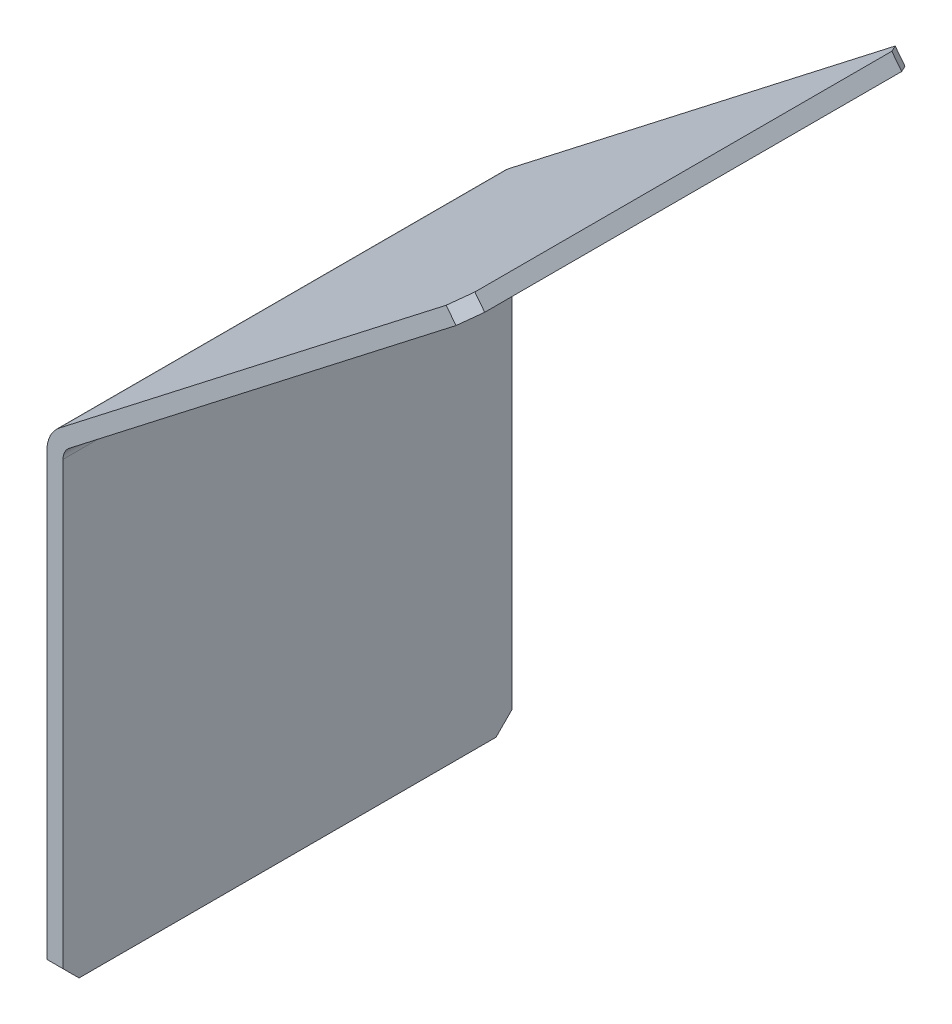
ISO-10303-21;
HEADER;
FILE_DESCRIPTION(('STEP AP214'),'2;1');
FILE_NAME('part.step','',(''),(''),'','','');
FILE_SCHEMA(('AUTOMOTIVE_DESIGN { 1 0 10303 214 1 1 1 1 }'));
ENDSEC;
DATA;
#1=APPLICATION_CONTEXT('core data for automotive mechanical design processes');
#2=APPLICATION_PROTOCOL_DEFINITION('international standard','automotive_design',2000,#1);
#3=PRODUCT_CONTEXT('',#1,'mechanical');
#4=PRODUCT('Part','Part','',(#3));
#5=PRODUCT_RELATED_PRODUCT_CATEGORY('part','',(#4));
#6=PRODUCT_DEFINITION_FORMATION('','',#4);
#7=PRODUCT_DEFINITION_CONTEXT('part definition',#1,'design');
#8=PRODUCT_DEFINITION('design','',#6,#7);
#9=PRODUCT_DEFINITION_SHAPE('','',#8);
#10=(LENGTH_UNIT() NAMED_UNIT(*) SI_UNIT(.MILLI.,.METRE.));
#11=(NAMED_UNIT(*) PLANE_ANGLE_UNIT() SI_UNIT($,.RADIAN.));
#12=(NAMED_UNIT(*) SI_UNIT($,.STERADIAN.) SOLID_ANGLE_UNIT());
#13=UNCERTAINTY_MEASURE_WITH_UNIT(LENGTH_MEASURE(1.E-05),#10,'distance_accuracy_value','');
#14=(GEOMETRIC_REPRESENTATION_CONTEXT(3) GLOBAL_UNCERTAINTY_ASSIGNED_CONTEXT((#13)) GLOBAL_UNIT_ASSIGNED_CONTEXT((#10,
#11,#12)) REPRESENTATION_CONTEXT('',''));
#15=CARTESIAN_POINT('',(0.,0.,0.));
#16=DIRECTION('',(0.,0.,1.));
#17=DIRECTION('',(1.,0.,0.));
#18=AXIS2_PLACEMENT_3D('',#15,#16,#17);
#19=CARTESIAN_POINT('',(1.9375,146.50128134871,70.));
#20=DIRECTION('',(-0.6125,0.790470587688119,0.));
#21=DIRECTION('',(-0.790470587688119,-0.6125,0.));
#22=AXIS2_PLACEMENT_3D('',#19,#20,#21);
#23=PLANE('',#22);
#24=DIRECTION('',(0.790470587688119,0.6125,0.));
#25=VECTOR('',#24,1.);
#26=CARTESIAN_POINT('',(1.9375,146.50128134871,-70.));
#27=LINE('',#26,#25);
#28=CARTESIAN_POINT('',(1.9375,146.50128134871,-70.));
#29=VERTEX_POINT('',#28);
#30=CARTESIAN_POINT('',(122.522941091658,239.9375,-70.));
#31=VERTEX_POINT('',#30);
#32=EDGE_CURVE('E152',#29,#31,#27,.T.);
#33=ORIENTED_EDGE('',*,*,#32,.T.);
#34=DIRECTION('',(0.558947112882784,0.43310290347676,0.707106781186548));
#35=VECTOR('',#34,1.);
#36=CARTESIAN_POINT('',(122.522941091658,239.9375,-70.));
#37=LINE('',#36,#35);
#38=CARTESIAN_POINT('',(126.475294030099,243.,-65.0000000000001));
#39=VERTEX_POINT('',#38);
#40=EDGE_CURVE('E202',#31,#39,#37,.T.);
#41=ORIENTED_EDGE('',*,*,#40,.T.);
#42=DIRECTION('',(0.,0.,-1.));
#43=VECTOR('',#42,1.);
#44=CARTESIAN_POINT('',(126.475294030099,243.,70.));
#45=LINE('',#44,#43);
#46=CARTESIAN_POINT('',(126.475294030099,243.,65.));
#47=VERTEX_POINT('',#46);
#48=EDGE_CURVE('E177',#47,#39,#45,.T.);
#49=ORIENTED_EDGE('',*,*,#48,.F.);
#50=DIRECTION('',(0.558947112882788,0.433102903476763,-0.707106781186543));
#51=VECTOR('',#50,1.);
#52=CARTESIAN_POINT('',(126.475294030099,243.,65.));
#53=LINE('',#52,#51);
#54=CARTESIAN_POINT('',(122.522941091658,239.9375,70.));
#55=VERTEX_POINT('',#54);
#56=EDGE_CURVE('E200',#47,#55,#53,.F.);
#57=ORIENTED_EDGE('',*,*,#56,.T.);
#58=DIRECTION('',(0.790470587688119,0.6125,0.));
#59=VECTOR('',#58,1.);
#60=CARTESIAN_POINT('',(1.9375,146.50128134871,70.));
#61=LINE('',#60,#59);
#62=CARTESIAN_POINT('',(1.9375,146.50128134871,70.));
#63=VERTEX_POINT('',#62);
#64=EDGE_CURVE('E137',#63,#55,#61,.T.);
#65=ORIENTED_EDGE('',*,*,#64,.F.);
#66=DIRECTION('',(0.,0.,-1.));
#67=VECTOR('',#66,1.);
#68=CARTESIAN_POINT('',(1.9375,146.50128134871,70.));
#69=LINE('',#68,#67);
#70=EDGE_CURVE('E151',#63,#29,#69,.T.);
#71=ORIENTED_EDGE('',*,*,#70,.T.);
#72=EDGE_LOOP('',(#33,#41,#49,#57,#65,#71));
#73=FACE_BOUND('',#72,.T.);
#74=ADVANCED_FACE('F30',(#73),#23,.F.);
#75=CARTESIAN_POINT('',(123.412794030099,246.952352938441,70.));
#76=DIRECTION('',(0.790470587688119,0.612499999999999,0.));
#77=DIRECTION('',(-0.612499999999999,0.790470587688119,0.));
#78=AXIS2_PLACEMENT_3D('',#75,#76,#77);
#79=PLANE('',#78);
#80=ORIENTED_EDGE('',*,*,#48,.T.);
#81=DIRECTION('',(-0.612499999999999,0.790470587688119,0.));
#82=VECTOR('',#81,1.);
#83=CARTESIAN_POINT('',(123.412794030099,246.952352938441,-65.0000000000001));
#84=LINE('',#83,#82);
#85=CARTESIAN_POINT('',(123.412794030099,246.952352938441,-65.));
#86=VERTEX_POINT('',#85);
#87=EDGE_CURVE('E51',#39,#86,#84,.T.);
#88=ORIENTED_EDGE('',*,*,#87,.T.);
#89=DIRECTION('',(0.,0.,-1.));
#90=VECTOR('',#89,1.);
#91=CARTESIAN_POINT('',(123.412794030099,246.952352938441,70.));
#92=LINE('',#91,#90);
#93=CARTESIAN_POINT('',(123.412794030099,246.952352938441,65.));
#94=VERTEX_POINT('',#93);
#95=EDGE_CURVE('E130',#94,#86,#92,.T.);
#96=ORIENTED_EDGE('',*,*,#95,.F.);
#97=DIRECTION('',(0.612499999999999,-0.790470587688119,0.));
#98=VECTOR('',#97,1.);
#99=CARTESIAN_POINT('',(123.412794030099,246.952352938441,65.));
#100=LINE('',#99,#98);
#101=EDGE_CURVE('E204',#94,#47,#100,.T.);
#102=ORIENTED_EDGE('',*,*,#101,.T.);
#103=EDGE_LOOP('',(#80,#88,#96,#102));
#104=FACE_BOUND('',#103,.T.);
#105=ADVANCED_FACE('F218',(#104),#79,.T.);
#106=CARTESIAN_POINT('',(-1.125,150.453634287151,70.));
#107=DIRECTION('',(-0.6125,0.790470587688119,0.));
#108=DIRECTION('',(-0.790470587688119,-0.6125,0.));
#109=AXIS2_PLACEMENT_3D('',#106,#107,#108);
#110=PLANE('',#109);
#111=ORIENTED_EDGE('',*,*,#95,.T.);
#112=DIRECTION('',(-0.558947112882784,-0.43310290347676,-0.707106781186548));
#113=VECTOR('',#112,1.);
#114=CARTESIAN_POINT('',(114.500661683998,240.046743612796,-76.2744642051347));
#115=LINE('',#114,#113);
#116=CARTESIAN_POINT('',(119.460441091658,243.889852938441,-70.));
#117=VERTEX_POINT('',#116);
#118=EDGE_CURVE('E38',#86,#117,#115,.T.);
#119=ORIENTED_EDGE('',*,*,#118,.T.);
#120=DIRECTION('',(0.790470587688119,0.6125,0.));
#121=VECTOR('',#120,1.);
#122=CARTESIAN_POINT('',(-1.125,150.453634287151,-70.));
#123=LINE('',#122,#121);
#124=CARTESIAN_POINT('',(-1.125,150.453634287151,-70.));
#125=VERTEX_POINT('',#124);
#126=EDGE_CURVE('E125',#125,#117,#123,.T.);
#127=ORIENTED_EDGE('',*,*,#126,.F.);
#128=DIRECTION('',(0.,0.,-1.));
#129=VECTOR('',#128,1.);
#130=CARTESIAN_POINT('',(-1.125,150.453634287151,70.));
#131=LINE('',#130,#129);
#132=CARTESIAN_POINT('',(-1.125,150.453634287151,70.));
#133=VERTEX_POINT('',#132);
#134=EDGE_CURVE('E120',#133,#125,#131,.T.);
#135=ORIENTED_EDGE('',*,*,#134,.F.);
#136=DIRECTION('',(0.790470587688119,0.6125,0.));
#137=VECTOR('',#136,1.);
#138=CARTESIAN_POINT('',(-1.125,150.453634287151,70.));
#139=LINE('',#138,#137);
#140=CARTESIAN_POINT('',(119.460441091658,243.889852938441,70.));
#141=VERTEX_POINT('',#140);
#142=EDGE_CURVE('E122',#133,#141,#139,.T.);
#143=ORIENTED_EDGE('',*,*,#142,.T.);
#144=DIRECTION('',(-0.558947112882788,-0.433102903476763,0.707106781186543));
#145=VECTOR('',#144,1.);
#146=CARTESIAN_POINT('',(59.1677205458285,197.171743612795,146.274464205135));
#147=LINE('',#146,#145);
#148=EDGE_CURVE('E208',#141,#94,#147,.F.);
#149=ORIENTED_EDGE('',*,*,#148,.T.);
#150=EDGE_LOOP('',(#111,#119,#127,#135,#143,#149));
#151=FACE_BOUND('',#150,.T.);
#152=ADVANCED_FACE('F121',(#151),#110,.T.);
#153=CARTESIAN_POINT('',(5.,142.548928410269,70.));
#154=DIRECTION('',(0.,0.,-1.));
#155=DIRECTION('',(-1.,0.,0.));
#156=AXIS2_PLACEMENT_3D('',#153,#154,#155);
#157=CYLINDRICAL_SURFACE('',#156,10.);
#158=CARTESIAN_POINT('',(5.,142.548928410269,-70.));
#159=DIRECTION('',(0.,0.,1.));
#160=DIRECTION('',(1.,0.,0.));
#161=AXIS2_PLACEMENT_3D('',#158,#159,#160);
#162=CIRCLE('',#161,10.);
#163=CARTESIAN_POINT('',(-5.,142.548928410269,-70.));
#164=VERTEX_POINT('',#163);
#165=EDGE_CURVE('E156',#164,#125,#162,.F.);
#166=ORIENTED_EDGE('',*,*,#165,.F.);
#167=DIRECTION('',(0.,0.,-1.));
#168=VECTOR('',#167,1.);
#169=CARTESIAN_POINT('',(-5.,142.548928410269,70.));
#170=LINE('',#169,#168);
#171=CARTESIAN_POINT('',(-5.,142.548928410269,70.));
#172=VERTEX_POINT('',#171);
#173=EDGE_CURVE('E131',#172,#164,#170,.T.);
#174=ORIENTED_EDGE('',*,*,#173,.F.);
#175=CARTESIAN_POINT('',(5.,142.548928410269,70.));
#176=DIRECTION('',(0.,0.,1.));
#177=DIRECTION('',(1.,0.,0.));
#178=AXIS2_PLACEMENT_3D('',#175,#176,#177);
#179=CIRCLE('',#178,10.);
#180=EDGE_CURVE('E136',#172,#133,#179,.F.);
#181=ORIENTED_EDGE('',*,*,#180,.T.);
#182=ORIENTED_EDGE('',*,*,#134,.T.);
#183=EDGE_LOOP('',(#166,#174,#181,#182));
#184=FACE_BOUND('',#183,.T.);
#185=ADVANCED_FACE('F140',(#184),#157,.T.);
#186=CARTESIAN_POINT('',(-5.,0.,70.));
#187=DIRECTION('',(-1.,0.,0.));
#188=DIRECTION('',(0.,0.,1.));
#189=AXIS2_PLACEMENT_3D('',#186,#187,#188);
#190=PLANE('',#189);
#191=DIRECTION('',(0.,1.,0.));
#192=VECTOR('',#191,1.);
#193=CARTESIAN_POINT('',(-5.,0.,-70.));
#194=LINE('',#193,#192);
#195=CARTESIAN_POINT('',(-5.,4.99999999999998,-70.));
#196=VERTEX_POINT('',#195);
#197=EDGE_CURVE('E158',#196,#164,#194,.T.);
#198=ORIENTED_EDGE('',*,*,#197,.F.);
#199=DIRECTION('',(0.,-0.707106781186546,0.707106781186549));
#200=VECTOR('',#199,1.);
#201=CARTESIAN_POINT('',(-5.,-67.5,2.50000000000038));
#202=LINE('',#201,#200);
#203=CARTESIAN_POINT('',(-5.,0.,-65.));
#204=VERTEX_POINT('',#203);
#205=EDGE_CURVE('E184',#196,#204,#202,.T.);
#206=ORIENTED_EDGE('',*,*,#205,.T.);
#207=DIRECTION('',(0.,0.,-1.));
#208=VECTOR('',#207,1.);
#209=CARTESIAN_POINT('',(-5.,0.,70.));
#210=LINE('',#209,#208);
#211=CARTESIAN_POINT('',(-5.,0.,65.));
#212=VERTEX_POINT('',#211);
#213=EDGE_CURVE('E172',#212,#204,#210,.T.);
#214=ORIENTED_EDGE('',*,*,#213,.F.);
#215=DIRECTION('',(0.,-0.707106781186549,-0.707106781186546));
#216=VECTOR('',#215,1.);
#217=CARTESIAN_POINT('',(-5.,2.49999999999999,67.5));
#218=LINE('',#217,#216);
#219=CARTESIAN_POINT('',(-5.,5.,70.));
#220=VERTEX_POINT('',#219);
#221=EDGE_CURVE('E182',#212,#220,#218,.F.);
#222=ORIENTED_EDGE('',*,*,#221,.T.);
#223=DIRECTION('',(0.,1.,0.));
#224=VECTOR('',#223,1.);
#225=CARTESIAN_POINT('',(-5.,0.,70.));
#226=LINE('',#225,#224);
#227=EDGE_CURVE('E142',#220,#172,#226,.T.);
#228=ORIENTED_EDGE('',*,*,#227,.T.);
#229=ORIENTED_EDGE('',*,*,#173,.T.);
#230=EDGE_LOOP('',(#198,#206,#214,#222,#228,#229));
#231=FACE_BOUND('',#230,.T.);
#232=ADVANCED_FACE('F239',(#231),#190,.T.);
#233=CARTESIAN_POINT('',(0.,0.,70.));
#234=DIRECTION('',(0.,-1.,0.));
#235=DIRECTION('',(0.,0.,-1.));
#236=AXIS2_PLACEMENT_3D('',#233,#234,#235);
#237=PLANE('',#236);
#238=ORIENTED_EDGE('',*,*,#213,.T.);
#239=DIRECTION('',(1.,0.,0.));
#240=VECTOR('',#239,1.);
#241=CARTESIAN_POINT('',(0.,0.,-65.));
#242=LINE('',#241,#240);
#243=CARTESIAN_POINT('',(0.,0.,-65.));
#244=VERTEX_POINT('',#243);
#245=EDGE_CURVE('E189',#204,#244,#242,.T.);
#246=ORIENTED_EDGE('',*,*,#245,.T.);
#247=DIRECTION('',(0.,0.,-1.));
#248=VECTOR('',#247,1.);
#249=CARTESIAN_POINT('',(0.,0.,70.));
#250=LINE('',#249,#248);
#251=CARTESIAN_POINT('',(0.,0.,65.));
#252=VERTEX_POINT('',#251);
#253=EDGE_CURVE('E169',#252,#244,#250,.T.);
#254=ORIENTED_EDGE('',*,*,#253,.F.);
#255=DIRECTION('',(-1.,0.,0.));
#256=VECTOR('',#255,1.);
#257=CARTESIAN_POINT('',(0.,0.,65.));
#258=LINE('',#257,#256);
#259=EDGE_CURVE('E186',#252,#212,#258,.T.);
#260=ORIENTED_EDGE('',*,*,#259,.T.);
#261=EDGE_LOOP('',(#238,#246,#254,#260));
#262=FACE_BOUND('',#261,.T.);
#263=ADVANCED_FACE('F241',(#262),#237,.T.);
#264=CARTESIAN_POINT('',(0.,0.,70.));
#265=DIRECTION('',(-1.,0.,0.));
#266=DIRECTION('',(0.,0.,1.));
#267=AXIS2_PLACEMENT_3D('',#264,#265,#266);
#268=PLANE('',#267);
#269=ORIENTED_EDGE('',*,*,#253,.T.);
#270=DIRECTION('',(0.,0.707106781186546,-0.707106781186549));
#271=VECTOR('',#270,1.);
#272=CARTESIAN_POINT('',(0.,5.,-70.));
#273=LINE('',#272,#271);
#274=CARTESIAN_POINT('',(0.,5.,-70.));
#275=VERTEX_POINT('',#274);
#276=EDGE_CURVE('E193',#244,#275,#273,.T.);
#277=ORIENTED_EDGE('',*,*,#276,.T.);
#278=DIRECTION('',(0.,1.,0.));
#279=VECTOR('',#278,1.);
#280=CARTESIAN_POINT('',(0.,0.,-70.));
#281=LINE('',#280,#279);
#282=CARTESIAN_POINT('',(0.,142.548928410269,-70.));
#283=VERTEX_POINT('',#282);
#284=EDGE_CURVE('E160',#275,#283,#281,.T.);
#285=ORIENTED_EDGE('',*,*,#284,.T.);
#286=DIRECTION('',(0.,0.,-1.));
#287=VECTOR('',#286,1.);
#288=CARTESIAN_POINT('',(0.,142.548928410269,70.));
#289=LINE('',#288,#287);
#290=CARTESIAN_POINT('',(0.,142.548928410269,70.));
#291=VERTEX_POINT('',#290);
#292=EDGE_CURVE('E166',#291,#283,#289,.T.);
#293=ORIENTED_EDGE('',*,*,#292,.F.);
#294=DIRECTION('',(0.,1.,0.));
#295=VECTOR('',#294,1.);
#296=CARTESIAN_POINT('',(0.,0.,70.));
#297=LINE('',#296,#295);
#298=CARTESIAN_POINT('',(0.,5.,70.));
#299=VERTEX_POINT('',#298);
#300=EDGE_CURVE('E144',#299,#291,#297,.T.);
#301=ORIENTED_EDGE('',*,*,#300,.F.);
#302=DIRECTION('',(0.,0.707106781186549,0.707106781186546));
#303=VECTOR('',#302,1.);
#304=CARTESIAN_POINT('',(0.,0.,65.));
#305=LINE('',#304,#303);
#306=EDGE_CURVE('E191',#299,#252,#305,.F.);
#307=ORIENTED_EDGE('',*,*,#306,.T.);
#308=EDGE_LOOP('',(#269,#277,#285,#293,#301,#307));
#309=FACE_BOUND('',#308,.T.);
#310=ADVANCED_FACE('F248',(#309),#268,.F.);
#311=CARTESIAN_POINT('',(5.,142.548928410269,70.));
#312=DIRECTION('',(0.,0.,-1.));
#313=DIRECTION('',(-1.,0.,0.));
#314=AXIS2_PLACEMENT_3D('',#311,#312,#313);
#315=CYLINDRICAL_SURFACE('',#314,5.);
#316=CARTESIAN_POINT('',(5.,142.548928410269,-70.));
#317=DIRECTION('',(0.,0.,-1.));
#318=DIRECTION('',(-1.,0.,0.));
#319=AXIS2_PLACEMENT_3D('',#316,#317,#318);
#320=CIRCLE('',#319,5.);
#321=EDGE_CURVE('E162',#283,#29,#320,.T.);
#322=ORIENTED_EDGE('',*,*,#321,.T.);
#323=ORIENTED_EDGE('',*,*,#70,.F.);
#324=CARTESIAN_POINT('',(5.,142.548928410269,70.));
#325=DIRECTION('',(0.,0.,-1.));
#326=DIRECTION('',(-1.,0.,0.));
#327=AXIS2_PLACEMENT_3D('',#324,#325,#326);
#328=CIRCLE('',#327,5.);
#329=EDGE_CURVE('E149',#291,#63,#328,.T.);
#330=ORIENTED_EDGE('',*,*,#329,.F.);
#331=ORIENTED_EDGE('',*,*,#292,.T.);
#332=EDGE_LOOP('',(#322,#323,#330,#331));
#333=FACE_BOUND('',#332,.T.);
#334=ADVANCED_FACE('F227',(#333),#315,.F.);
#335=CARTESIAN_POINT('',(5.,142.548928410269,70.));
#336=DIRECTION('',(0.,0.,1.));
#337=DIRECTION('',(1.,0.,0.));
#338=AXIS2_PLACEMENT_3D('',#335,#336,#337);
#339=PLANE('',#338);
#340=ORIENTED_EDGE('',*,*,#64,.T.);
#341=DIRECTION('',(-0.612499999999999,0.790470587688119,0.));
#342=VECTOR('',#341,1.);
#343=CARTESIAN_POINT('',(125.585441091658,235.985147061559,70.));
#344=LINE('',#343,#342);
#345=EDGE_CURVE('E11',#55,#141,#344,.T.);
#346=ORIENTED_EDGE('',*,*,#345,.T.);
#347=ORIENTED_EDGE('',*,*,#142,.F.);
#348=ORIENTED_EDGE('',*,*,#180,.F.);
#349=ORIENTED_EDGE('',*,*,#227,.F.);
#350=DIRECTION('',(1.,0.,0.));
#351=VECTOR('',#350,1.);
#352=CARTESIAN_POINT('',(5.,5.,70.));
#353=LINE('',#352,#351);
#354=EDGE_CURVE('E195',#220,#299,#353,.T.);
#355=ORIENTED_EDGE('',*,*,#354,.T.);
#356=ORIENTED_EDGE('',*,*,#300,.T.);
#357=ORIENTED_EDGE('',*,*,#329,.T.);
#358=EDGE_LOOP('',(#340,#346,#347,#348,#349,#355,#356,#357));
#359=FACE_BOUND('',#358,.T.);
#360=ADVANCED_FACE('F134',(#359),#339,.T.);
#361=CARTESIAN_POINT('',(5.,142.548928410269,-70.));
#362=DIRECTION('',(0.,0.,1.));
#363=DIRECTION('',(1.,0.,0.));
#364=AXIS2_PLACEMENT_3D('',#361,#362,#363);
#365=PLANE('',#364);
#366=ORIENTED_EDGE('',*,*,#126,.T.);
#367=DIRECTION('',(0.612499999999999,-0.790470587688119,0.));
#368=VECTOR('',#367,1.);
#369=CARTESIAN_POINT('',(122.522941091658,239.9375,-70.));
#370=LINE('',#369,#368);
#371=EDGE_CURVE('E197',#117,#31,#370,.T.);
#372=ORIENTED_EDGE('',*,*,#371,.T.);
#373=ORIENTED_EDGE('',*,*,#32,.F.);
#374=ORIENTED_EDGE('',*,*,#321,.F.);
#375=ORIENTED_EDGE('',*,*,#284,.F.);
#376=DIRECTION('',(-1.,0.,0.));
#377=VECTOR('',#376,1.);
#378=CARTESIAN_POINT('',(-5.,5.,-70.));
#379=LINE('',#378,#377);
#380=EDGE_CURVE('E179',#275,#196,#379,.T.);
#381=ORIENTED_EDGE('',*,*,#380,.T.);
#382=ORIENTED_EDGE('',*,*,#197,.T.);
#383=ORIENTED_EDGE('',*,*,#165,.T.);
#384=EDGE_LOOP('',(#366,#372,#373,#374,#375,#381,#382,#383));
#385=FACE_BOUND('',#384,.T.);
#386=ADVANCED_FACE('F213',(#385),#365,.F.);
#387=CARTESIAN_POINT('',(5.,5.,-70.));
#388=DIRECTION('',(0.,-0.707106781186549,-0.707106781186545));
#389=DIRECTION('',(0.,0.707106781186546,-0.707106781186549));
#390=AXIS2_PLACEMENT_3D('',#387,#388,#389);
#391=PLANE('',#390);
#392=ORIENTED_EDGE('',*,*,#276,.F.);
#393=ORIENTED_EDGE('',*,*,#245,.F.);
#394=ORIENTED_EDGE('',*,*,#205,.F.);
#395=ORIENTED_EDGE('',*,*,#380,.F.);
#396=EDGE_LOOP('',(#392,#393,#394,#395));
#397=FACE_BOUND('',#396,.T.);
#398=ADVANCED_FACE('F235',(#397),#391,.T.);
#399=CARTESIAN_POINT('',(0.,0.,65.));
#400=DIRECTION('',(0.,0.707106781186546,-0.707106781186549));
#401=DIRECTION('',(0.,0.707106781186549,0.707106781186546));
#402=AXIS2_PLACEMENT_3D('',#399,#400,#401);
#403=PLANE('',#402);
#404=ORIENTED_EDGE('',*,*,#306,.F.);
#405=ORIENTED_EDGE('',*,*,#354,.F.);
#406=ORIENTED_EDGE('',*,*,#221,.F.);
#407=ORIENTED_EDGE('',*,*,#259,.F.);
#408=EDGE_LOOP('',(#404,#405,#406,#407));
#409=FACE_BOUND('',#408,.T.);
#410=ADVANCED_FACE('F246',(#409),#403,.F.);
#411=CARTESIAN_POINT('',(125.585441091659,235.985147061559,-70.));
#412=DIRECTION('',(0.558947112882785,0.43310290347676,-0.707106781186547));
#413=DIRECTION('',(-0.784502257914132,0.,-0.620125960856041));
#414=AXIS2_PLACEMENT_3D('',#411,#412,#413);
#415=PLANE('',#414);
#416=ORIENTED_EDGE('',*,*,#118,.F.);
#417=ORIENTED_EDGE('',*,*,#87,.F.);
#418=ORIENTED_EDGE('',*,*,#40,.F.);
#419=ORIENTED_EDGE('',*,*,#371,.F.);
#420=EDGE_LOOP('',(#416,#417,#418,#419));
#421=FACE_BOUND('',#420,.T.);
#422=ADVANCED_FACE('F215',(#421),#415,.T.);
#423=CARTESIAN_POINT('',(123.412794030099,246.952352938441,65.));
#424=DIRECTION('',(-0.558947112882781,-0.433102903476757,-0.707106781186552));
#425=DIRECTION('',(-0.784502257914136,0.,0.620125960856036));
#426=AXIS2_PLACEMENT_3D('',#423,#424,#425);
#427=PLANE('',#426);
#428=ORIENTED_EDGE('',*,*,#148,.F.);
#429=ORIENTED_EDGE('',*,*,#345,.F.);
#430=ORIENTED_EDGE('',*,*,#56,.F.);
#431=ORIENTED_EDGE('',*,*,#101,.F.);
#432=EDGE_LOOP('',(#428,#429,#430,#431));
#433=FACE_BOUND('',#432,.T.);
#434=ADVANCED_FACE('F32',(#433),#427,.F.);
#435=CLOSED_SHELL('',(#74,#105,#152,#185,#232,#263,#310,#334,#360,#386,#398,#410,#422,#434));
#436=MANIFOLD_SOLID_BREP('B2',#435);
#437=ADVANCED_BREP_SHAPE_REPRESENTATION('',(#18,#436),#14);
#438=SHAPE_DEFINITION_REPRESENTATION(#9,#437);
ENDSEC;
END-ISO-10303-21;
